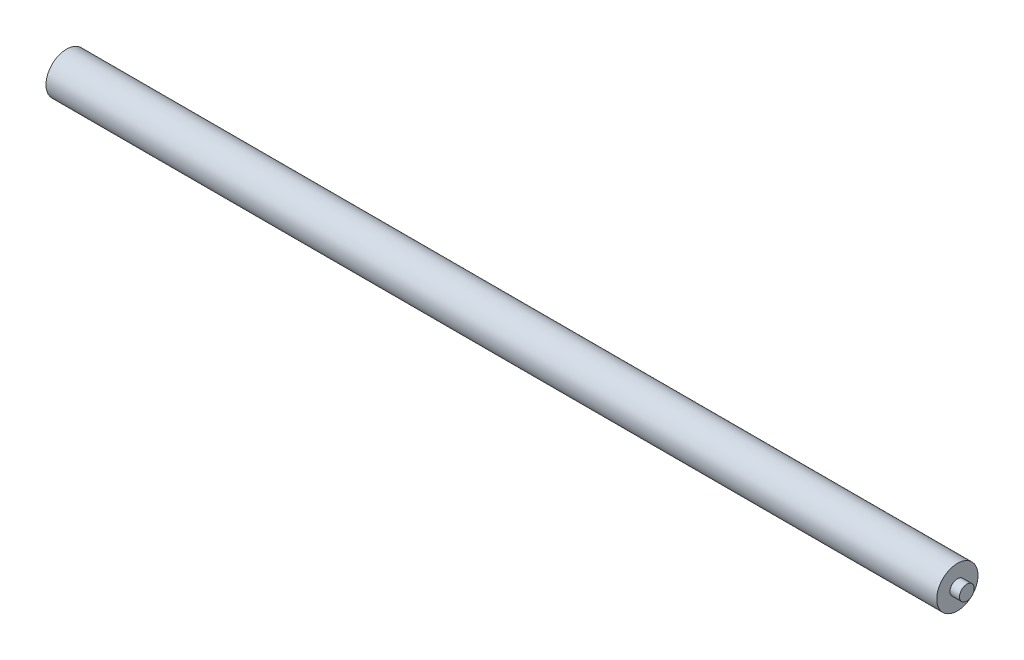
ISO-10303-21;
HEADER;
FILE_DESCRIPTION(('STEP AP214'),'2;1');
FILE_NAME('part.step','',(''),(''),'','','');
FILE_SCHEMA(('AUTOMOTIVE_DESIGN { 1 0 10303 214 1 1 1 1 }'));
ENDSEC;
DATA;
#1=APPLICATION_CONTEXT('core data for automotive mechanical design processes');
#2=APPLICATION_PROTOCOL_DEFINITION('international standard','automotive_design',2000,#1);
#3=PRODUCT_CONTEXT('',#1,'mechanical');
#4=PRODUCT('Part','Part','',(#3));
#5=PRODUCT_RELATED_PRODUCT_CATEGORY('part','',(#4));
#6=PRODUCT_DEFINITION_FORMATION('','',#4);
#7=PRODUCT_DEFINITION_CONTEXT('part definition',#1,'design');
#8=PRODUCT_DEFINITION('design','',#6,#7);
#9=PRODUCT_DEFINITION_SHAPE('','',#8);
#10=(LENGTH_UNIT() NAMED_UNIT(*) SI_UNIT(.MILLI.,.METRE.));
#11=(NAMED_UNIT(*) PLANE_ANGLE_UNIT() SI_UNIT($,.RADIAN.));
#12=(NAMED_UNIT(*) SI_UNIT($,.STERADIAN.) SOLID_ANGLE_UNIT());
#13=UNCERTAINTY_MEASURE_WITH_UNIT(LENGTH_MEASURE(1.E-05),#10,'distance_accuracy_value','');
#14=(GEOMETRIC_REPRESENTATION_CONTEXT(3) GLOBAL_UNCERTAINTY_ASSIGNED_CONTEXT((#13)) GLOBAL_UNIT_ASSIGNED_CONTEXT((#10,
#11,#12)) REPRESENTATION_CONTEXT('',''));
#15=CARTESIAN_POINT('',(0.,0.,0.));
#16=DIRECTION('',(0.,0.,1.));
#17=DIRECTION('',(1.,0.,0.));
#18=AXIS2_PLACEMENT_3D('',#15,#16,#17);
#19=CARTESIAN_POINT('',(0.,0.,0.));
#20=DIRECTION('',(1.,0.,0.));
#21=DIRECTION('',(0.,0.,-1.));
#22=AXIS2_PLACEMENT_3D('',#19,#20,#21);
#23=CYLINDRICAL_SURFACE('',#22,5.08);
#24=CARTESIAN_POINT('',(0.,0.,0.));
#25=DIRECTION('',(1.,0.,0.));
#26=DIRECTION('',(0.,0.,-1.));
#27=AXIS2_PLACEMENT_3D('',#24,#25,#26);
#28=CIRCLE('',#27,5.08);
#29=CARTESIAN_POINT('',(0.,0.,-5.08));
#30=VERTEX_POINT('',#29);
#31=EDGE_CURVE('E41',#30,#30,#28,.T.);
#32=ORIENTED_EDGE('',*,*,#31,.T.);
#33=EDGE_LOOP('',(#32));
#34=FACE_BOUND('',#33,.T.);
#35=CARTESIAN_POINT('',(-474.6625,0.,0.));
#36=DIRECTION('',(1.,0.,0.));
#37=DIRECTION('',(0.,0.,-1.));
#38=AXIS2_PLACEMENT_3D('',#35,#36,#37);
#39=CIRCLE('',#38,5.08);
#40=CARTESIAN_POINT('',(-474.6625,0.,-5.08));
#41=VERTEX_POINT('',#40);
#42=EDGE_CURVE('E10',#41,#41,#39,.T.);
#43=ORIENTED_EDGE('',*,*,#42,.F.);
#44=EDGE_LOOP('',(#43));
#45=FACE_BOUND('',#44,.T.);
#46=ADVANCED_FACE('F31',(#34,#45),#23,.F.);
#47=CARTESIAN_POINT('',(-474.6625,5.08,0.));
#48=DIRECTION('',(-1.,0.,0.));
#49=DIRECTION('',(0.,0.,1.));
#50=AXIS2_PLACEMENT_3D('',#47,#48,#49);
#51=PLANE('',#50);
#52=ORIENTED_EDGE('',*,*,#42,.T.);
#53=EDGE_LOOP('',(#52));
#54=FACE_BOUND('',#53,.T.);
#55=CARTESIAN_POINT('',(-474.6625,0.,0.));
#56=DIRECTION('',(1.,0.,0.));
#57=DIRECTION('',(0.,0.,-1.));
#58=AXIS2_PLACEMENT_3D('',#55,#56,#57);
#59=CIRCLE('',#58,11.049);
#60=CARTESIAN_POINT('',(-474.6625,0.,-11.049));
#61=VERTEX_POINT('',#60);
#62=EDGE_CURVE('E37',#61,#61,#59,.T.);
#63=ORIENTED_EDGE('',*,*,#62,.F.);
#64=EDGE_LOOP('',(#63));
#65=FACE_BOUND('',#64,.T.);
#66=ADVANCED_FACE('F75',(#54,#65),#51,.T.);
#67=CARTESIAN_POINT('',(0.,0.,0.));
#68=DIRECTION('',(1.,0.,0.));
#69=DIRECTION('',(0.,0.,-1.));
#70=AXIS2_PLACEMENT_3D('',#67,#68,#69);
#71=CYLINDRICAL_SURFACE('',#70,11.049);
#72=ORIENTED_EDGE('',*,*,#62,.T.);
#73=EDGE_LOOP('',(#72));
#74=FACE_BOUND('',#73,.T.);
#75=CARTESIAN_POINT('',(2.54,0.,0.));
#76=DIRECTION('',(1.,0.,0.));
#77=DIRECTION('',(0.,0.,-1.));
#78=AXIS2_PLACEMENT_3D('',#75,#76,#77);
#79=CIRCLE('',#78,11.049);
#80=CARTESIAN_POINT('',(2.54,0.,-11.049));
#81=VERTEX_POINT('',#80);
#82=EDGE_CURVE('E45',#81,#81,#79,.T.);
#83=ORIENTED_EDGE('',*,*,#82,.F.);
#84=EDGE_LOOP('',(#83));
#85=FACE_BOUND('',#84,.T.);
#86=ADVANCED_FACE('F80',(#74,#85),#71,.T.);
#87=CARTESIAN_POINT('',(2.54,0.,0.));
#88=DIRECTION('',(1.,0.,0.));
#89=DIRECTION('',(0.,0.,-1.));
#90=AXIS2_PLACEMENT_3D('',#87,#88,#89);
#91=PLANE('',#90);
#92=CARTESIAN_POINT('',(2.54,0.,0.));
#93=DIRECTION('',(1.,0.,0.));
#94=DIRECTION('',(0.,0.,-1.));
#95=AXIS2_PLACEMENT_3D('',#92,#93,#94);
#96=CIRCLE('',#95,3.937);
#97=CARTESIAN_POINT('',(2.54,0.,3.937));
#98=VERTEX_POINT('',#97);
#99=EDGE_CURVE('E50',#98,#98,#96,.F.);
#100=ORIENTED_EDGE('',*,*,#99,.T.);
#101=EDGE_LOOP('',(#100));
#102=FACE_BOUND('',#101,.T.);
#103=ORIENTED_EDGE('',*,*,#82,.T.);
#104=EDGE_LOOP('',(#103));
#105=FACE_BOUND('',#104,.T.);
#106=ADVANCED_FACE('F69',(#102,#105),#91,.T.);
#107=CARTESIAN_POINT('',(0.,0.,0.));
#108=DIRECTION('',(1.,0.,0.));
#109=DIRECTION('',(0.,0.,-1.));
#110=AXIS2_PLACEMENT_3D('',#107,#108,#109);
#111=PLANE('',#110);
#112=ORIENTED_EDGE('',*,*,#31,.F.);
#113=EDGE_LOOP('',(#112));
#114=FACE_BOUND('',#113,.T.);
#115=ADVANCED_FACE('F61',(#114),#111,.F.);
#116=CARTESIAN_POINT('',(7.62,0.,0.));
#117=DIRECTION('',(-1.,0.,0.));
#118=DIRECTION('',(0.,0.,1.));
#119=AXIS2_PLACEMENT_3D('',#116,#117,#118);
#120=CYLINDRICAL_SURFACE('',#119,3.937);
#121=CARTESIAN_POINT('',(7.62,0.,0.));
#122=DIRECTION('',(1.,0.,0.));
#123=DIRECTION('',(0.,0.,-1.));
#124=AXIS2_PLACEMENT_3D('',#121,#122,#123);
#125=CIRCLE('',#124,3.937);
#126=CARTESIAN_POINT('',(7.62,0.,3.937));
#127=VERTEX_POINT('',#126);
#128=EDGE_CURVE('E53',#127,#127,#125,.T.);
#129=CARTESIAN_POINT('',(2.54,0.,3.937));
#130=CARTESIAN_POINT('',(2.59291666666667,0.,3.937));
#131=CARTESIAN_POINT('',(2.64583333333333,0.,3.937));
#132=CARTESIAN_POINT('',(2.75166666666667,0.,3.937));
#133=CARTESIAN_POINT('',(2.80458333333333,0.,3.937));
#134=CARTESIAN_POINT('',(2.91041666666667,0.,3.937));
#135=CARTESIAN_POINT('',(2.96333333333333,0.,3.937));
#136=CARTESIAN_POINT('',(3.06916666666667,0.,3.937));
#137=CARTESIAN_POINT('',(3.12208333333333,0.,3.937));
#138=CARTESIAN_POINT('',(3.22791666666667,0.,3.937));
#139=CARTESIAN_POINT('',(3.28083333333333,0.,3.937));
#140=CARTESIAN_POINT('',(3.38666666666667,0.,3.937));
#141=CARTESIAN_POINT('',(3.43958333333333,0.,3.937));
#142=CARTESIAN_POINT('',(3.54541666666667,0.,3.937));
#143=CARTESIAN_POINT('',(3.59833333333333,0.,3.937));
#144=CARTESIAN_POINT('',(3.70416666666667,0.,3.937));
#145=CARTESIAN_POINT('',(3.75708333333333,0.,3.937));
#146=CARTESIAN_POINT('',(3.86291666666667,0.,3.937));
#147=CARTESIAN_POINT('',(3.91583333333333,0.,3.937));
#148=CARTESIAN_POINT('',(4.02166666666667,0.,3.937));
#149=CARTESIAN_POINT('',(4.07458333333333,0.,3.937));
#150=CARTESIAN_POINT('',(4.18041666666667,0.,3.937));
#151=CARTESIAN_POINT('',(4.23333333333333,0.,3.937));
#152=CARTESIAN_POINT('',(4.33916666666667,0.,3.937));
#153=CARTESIAN_POINT('',(4.39208333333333,0.,3.937));
#154=CARTESIAN_POINT('',(4.49791666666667,0.,3.937));
#155=CARTESIAN_POINT('',(4.55083333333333,0.,3.937));
#156=CARTESIAN_POINT('',(4.65666666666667,0.,3.937));
#157=CARTESIAN_POINT('',(4.70958333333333,0.,3.937));
#158=CARTESIAN_POINT('',(4.81541666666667,0.,3.937));
#159=CARTESIAN_POINT('',(4.86833333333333,0.,3.937));
#160=CARTESIAN_POINT('',(4.97416666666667,0.,3.937));
#161=CARTESIAN_POINT('',(5.02708333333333,0.,3.937));
#162=CARTESIAN_POINT('',(5.13291666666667,0.,3.937));
#163=CARTESIAN_POINT('',(5.18583333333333,0.,3.937));
#164=CARTESIAN_POINT('',(5.29166666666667,0.,3.937));
#165=CARTESIAN_POINT('',(5.34458333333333,0.,3.937));
#166=CARTESIAN_POINT('',(5.45041666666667,0.,3.937));
#167=CARTESIAN_POINT('',(5.50333333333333,0.,3.937));
#168=CARTESIAN_POINT('',(5.60916666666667,0.,3.937));
#169=CARTESIAN_POINT('',(5.66208333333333,0.,3.937));
#170=CARTESIAN_POINT('',(5.76791666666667,0.,3.937));
#171=CARTESIAN_POINT('',(5.82083333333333,0.,3.937));
#172=CARTESIAN_POINT('',(5.92666666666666,0.,3.937));
#173=CARTESIAN_POINT('',(5.97958333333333,0.,3.937));
#174=CARTESIAN_POINT('',(6.08541666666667,0.,3.937));
#175=CARTESIAN_POINT('',(6.13833333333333,0.,3.937));
#176=CARTESIAN_POINT('',(6.24416666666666,0.,3.937));
#177=CARTESIAN_POINT('',(6.29708333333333,0.,3.937));
#178=CARTESIAN_POINT('',(6.40291666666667,0.,3.937));
#179=CARTESIAN_POINT('',(6.45583333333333,0.,3.937));
#180=CARTESIAN_POINT('',(6.56166666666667,0.,3.937));
#181=CARTESIAN_POINT('',(6.61458333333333,0.,3.937));
#182=CARTESIAN_POINT('',(6.72041666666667,0.,3.937));
#183=CARTESIAN_POINT('',(6.77333333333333,0.,3.937));
#184=CARTESIAN_POINT('',(6.87916666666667,0.,3.937));
#185=CARTESIAN_POINT('',(6.93208333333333,0.,3.937));
#186=CARTESIAN_POINT('',(7.03791666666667,0.,3.937));
#187=CARTESIAN_POINT('',(7.09083333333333,0.,3.937));
#188=CARTESIAN_POINT('',(7.19666666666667,0.,3.937));
#189=CARTESIAN_POINT('',(7.24958333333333,0.,3.937));
#190=CARTESIAN_POINT('',(7.35541666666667,0.,3.937));
#191=CARTESIAN_POINT('',(7.40833333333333,0.,3.937));
#192=CARTESIAN_POINT('',(7.51416666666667,0.,3.937));
#193=CARTESIAN_POINT('',(7.56708333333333,0.,3.937));
#194=CARTESIAN_POINT('',(7.62,0.,3.937));
#195=B_SPLINE_CURVE_WITH_KNOTS('',3,(#129,#130,#131,#132,#133,#134,#135,#136,#137,#138,#139,
#140,#141,#142,#143,#144,#145,#146,#147,#148,#149,#150,#151,#152,#153,#154,#155,#156,#157,#158,
#159,#160,#161,#162,#163,#164,#165,#166,#167,#168,#169,#170,#171,#172,#173,#174,#175,#176,#177,
#178,#179,#180,#181,#182,#183,#184,#185,#186,#187,#188,#189,#190,#191,#192,#193,#194),
.UNSPECIFIED.,.F.,.F.,(4,2,2,2,2,2,2,2,2,2,2,2,2,2,2,2,2,2,2,2,2,2,2,2,2,2,2,2,2,2,2,2,4),(0.,
0.15875,0.3175,0.47625,0.635,0.79375,0.9525,1.11125,1.27,1.42875,1.5875,1.74625,1.905,2.06375,
2.2225,2.38125,2.54,2.69875,2.8575,3.01625,3.175,3.33375,3.4925,3.65125,3.81,3.96875,4.1275,
4.28625,4.445,4.60375,4.7625,4.92125,5.08),.UNSPECIFIED.);
#196=EDGE_CURVE('BSEAM59',#98,#127,#195,.T.);
#197=ORIENTED_EDGE('',*,*,#99,.F.);
#198=ORIENTED_EDGE('',*,*,#128,.F.);
#199=ORIENTED_EDGE('',*,*,#196,.T.);
#200=ORIENTED_EDGE('',*,*,#196,.F.);
#201=EDGE_LOOP('',(#197,#199,#198,#200));
#202=FACE_BOUND('',#201,.T.);
#203=ADVANCED_FACE('F59',(#202),#120,.T.);
#204=CARTESIAN_POINT('',(7.62,0.,0.));
#205=DIRECTION('',(1.,0.,0.));
#206=DIRECTION('',(0.,0.,-1.));
#207=AXIS2_PLACEMENT_3D('',#204,#205,#206);
#208=PLANE('',#207);
#209=ORIENTED_EDGE('',*,*,#128,.T.);
#210=EDGE_LOOP('',(#209));
#211=FACE_BOUND('',#210,.T.);
#212=ADVANCED_FACE('F57',(#211),#208,.T.);
#213=CLOSED_SHELL('',(#46,#66,#86,#106,#115,#203,#212));
#214=MANIFOLD_SOLID_BREP('B2',#213);
#215=ADVANCED_BREP_SHAPE_REPRESENTATION('',(#18,#214),#14);
#216=SHAPE_DEFINITION_REPRESENTATION(#9,#215);
ENDSEC;
END-ISO-10303-21;
